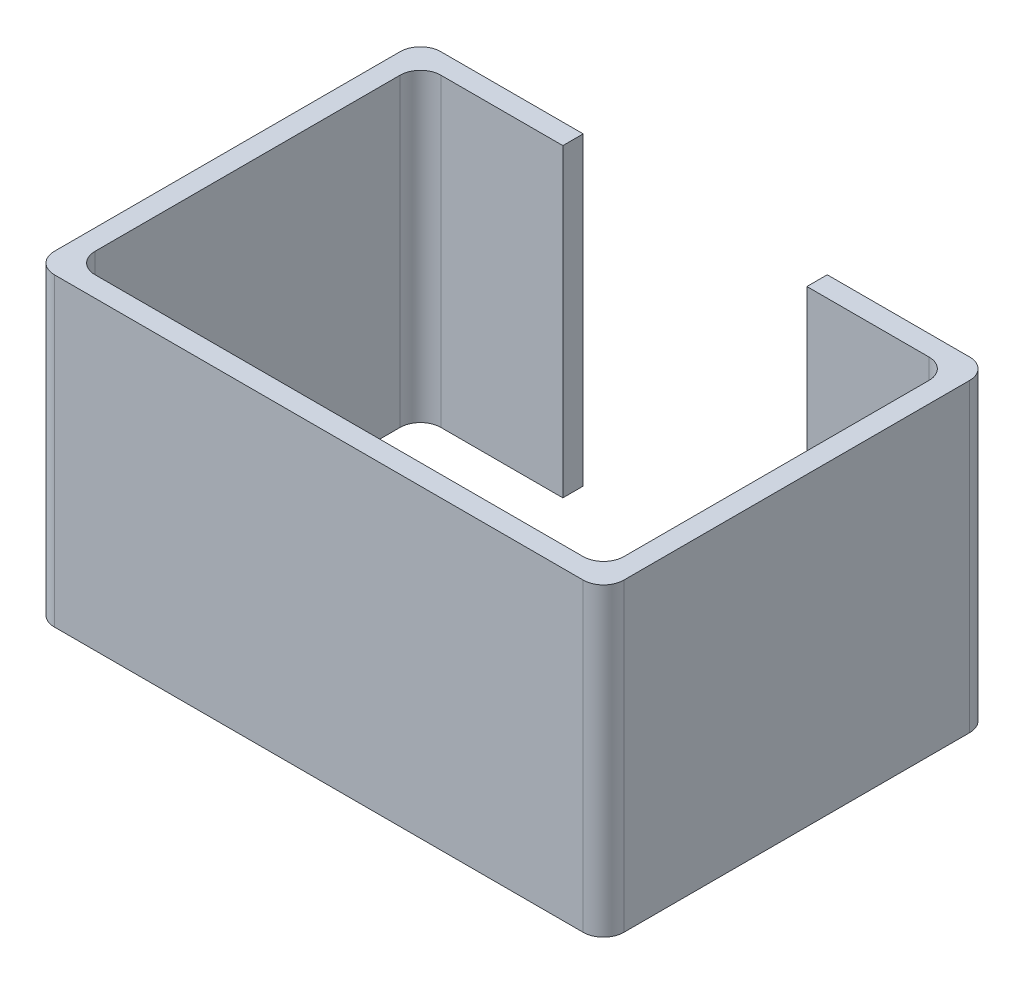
ISO-10303-21;
HEADER;
FILE_DESCRIPTION(('STEP AP214'),'2;1');
FILE_NAME('part.step','',(''),(''),'','','');
FILE_SCHEMA(('AUTOMOTIVE_DESIGN { 1 0 10303 214 1 1 1 1 }'));
ENDSEC;
DATA;
#1=APPLICATION_CONTEXT('core data for automotive mechanical design processes');
#2=APPLICATION_PROTOCOL_DEFINITION('international standard','automotive_design',2000,#1);
#3=PRODUCT_CONTEXT('',#1,'mechanical');
#4=PRODUCT('Part','Part','',(#3));
#5=PRODUCT_RELATED_PRODUCT_CATEGORY('part','',(#4));
#6=PRODUCT_DEFINITION_FORMATION('','',#4);
#7=PRODUCT_DEFINITION_CONTEXT('part definition',#1,'design');
#8=PRODUCT_DEFINITION('design','',#6,#7);
#9=PRODUCT_DEFINITION_SHAPE('','',#8);
#10=(LENGTH_UNIT() NAMED_UNIT(*) SI_UNIT(.MILLI.,.METRE.));
#11=(NAMED_UNIT(*) PLANE_ANGLE_UNIT() SI_UNIT($,.RADIAN.));
#12=(NAMED_UNIT(*) SI_UNIT($,.STERADIAN.) SOLID_ANGLE_UNIT());
#13=UNCERTAINTY_MEASURE_WITH_UNIT(LENGTH_MEASURE(1.E-05),#10,'distance_accuracy_value','');
#14=(GEOMETRIC_REPRESENTATION_CONTEXT(3) GLOBAL_UNCERTAINTY_ASSIGNED_CONTEXT((#13)) GLOBAL_UNIT_ASSIGNED_CONTEXT((#10,
#11,#12)) REPRESENTATION_CONTEXT('',''));
#15=CARTESIAN_POINT('',(0.,0.,0.));
#16=DIRECTION('',(0.,0.,1.));
#17=DIRECTION('',(1.,0.,0.));
#18=AXIS2_PLACEMENT_3D('',#15,#16,#17);
#19=CARTESIAN_POINT('',(0.,15.,0.));
#20=DIRECTION('',(-1.,0.,0.));
#21=DIRECTION('',(0.,0.,1.));
#22=AXIS2_PLACEMENT_3D('',#19,#20,#21);
#23=PLANE('',#22);
#24=DIRECTION('',(0.,0.,-1.));
#25=VECTOR('',#24,1.);
#26=CARTESIAN_POINT('',(0.,0.,0.));
#27=LINE('',#26,#25);
#28=CARTESIAN_POINT('',(0.,0.,1.));
#29=VERTEX_POINT('',#28);
#30=CARTESIAN_POINT('',(0.,0.,0.));
#31=VERTEX_POINT('',#30);
#32=EDGE_CURVE('E174',#29,#31,#27,.T.);
#33=ORIENTED_EDGE('',*,*,#32,.T.);
#34=DIRECTION('',(0.,-1.,0.));
#35=VECTOR('',#34,1.);
#36=CARTESIAN_POINT('',(0.,15.,0.));
#37=LINE('',#36,#35);
#38=CARTESIAN_POINT('',(0.,15.,0.));
#39=VERTEX_POINT('',#38);
#40=EDGE_CURVE('E181',#39,#31,#37,.T.);
#41=ORIENTED_EDGE('',*,*,#40,.F.);
#42=DIRECTION('',(0.,0.,-1.));
#43=VECTOR('',#42,1.);
#44=CARTESIAN_POINT('',(0.,15.,0.));
#45=LINE('',#44,#43);
#46=CARTESIAN_POINT('',(0.,15.,1.));
#47=VERTEX_POINT('',#46);
#48=EDGE_CURVE('E217',#47,#39,#45,.T.);
#49=ORIENTED_EDGE('',*,*,#48,.F.);
#50=DIRECTION('',(0.,-1.,0.));
#51=VECTOR('',#50,1.);
#52=CARTESIAN_POINT('',(0.,15.,1.));
#53=LINE('',#52,#51);
#54=EDGE_CURVE('E193',#47,#29,#53,.T.);
#55=ORIENTED_EDGE('',*,*,#54,.T.);
#56=EDGE_LOOP('',(#33,#41,#49,#55));
#57=FACE_BOUND('',#56,.T.);
#58=ADVANCED_FACE('F34',(#57),#23,.F.);
#59=CARTESIAN_POINT('',(0.,15.,0.));
#60=DIRECTION('',(0.,0.,1.));
#61=DIRECTION('',(1.,0.,0.));
#62=AXIS2_PLACEMENT_3D('',#59,#60,#61);
#63=PLANE('',#62);
#64=DIRECTION('',(-1.,0.,0.));
#65=VECTOR('',#64,1.);
#66=CARTESIAN_POINT('',(0.,0.,0.));
#67=LINE('',#66,#65);
#68=CARTESIAN_POINT('',(-7.,0.,0.));
#69=VERTEX_POINT('',#68);
#70=EDGE_CURVE('E169',#31,#69,#67,.T.);
#71=ORIENTED_EDGE('',*,*,#70,.T.);
#72=DIRECTION('',(0.,-1.,0.));
#73=VECTOR('',#72,1.);
#74=CARTESIAN_POINT('',(-7.,15.,0.));
#75=LINE('',#74,#73);
#76=CARTESIAN_POINT('',(-7.,15.,0.));
#77=VERTEX_POINT('',#76);
#78=EDGE_CURVE('E304',#69,#77,#75,.F.);
#79=ORIENTED_EDGE('',*,*,#78,.T.);
#80=DIRECTION('',(-1.,0.,0.));
#81=VECTOR('',#80,1.);
#82=CARTESIAN_POINT('',(0.,15.,0.));
#83=LINE('',#82,#81);
#84=EDGE_CURVE('E184',#39,#77,#83,.T.);
#85=ORIENTED_EDGE('',*,*,#84,.F.);
#86=ORIENTED_EDGE('',*,*,#40,.T.);
#87=EDGE_LOOP('',(#71,#79,#85,#86));
#88=FACE_BOUND('',#87,.T.);
#89=ADVANCED_FACE('F182',(#88),#63,.F.);
#90=CARTESIAN_POINT('',(-8.,15.,0.));
#91=DIRECTION('',(1.,0.,0.));
#92=DIRECTION('',(0.,0.,-1.));
#93=AXIS2_PLACEMENT_3D('',#90,#91,#92);
#94=PLANE('',#93);
#95=DIRECTION('',(0.,0.,1.));
#96=VECTOR('',#95,1.);
#97=CARTESIAN_POINT('',(-8.,15.,0.));
#98=LINE('',#97,#96);
#99=CARTESIAN_POINT('',(-8.,15.,1.));
#100=VERTEX_POINT('',#99);
#101=CARTESIAN_POINT('',(-8.,15.,18.));
#102=VERTEX_POINT('',#101);
#103=EDGE_CURVE('E220',#100,#102,#98,.T.);
#104=ORIENTED_EDGE('',*,*,#103,.F.);
#105=DIRECTION('',(0.,-1.,0.));
#106=VECTOR('',#105,1.);
#107=CARTESIAN_POINT('',(-8.,15.,1.));
#108=LINE('',#107,#106);
#109=CARTESIAN_POINT('',(-8.,0.,1.));
#110=VERTEX_POINT('',#109);
#111=EDGE_CURVE('E300',#100,#110,#108,.T.);
#112=ORIENTED_EDGE('',*,*,#111,.T.);
#113=DIRECTION('',(0.,0.,1.));
#114=VECTOR('',#113,1.);
#115=CARTESIAN_POINT('',(-8.,0.,0.));
#116=LINE('',#115,#114);
#117=CARTESIAN_POINT('',(-8.,0.,18.));
#118=VERTEX_POINT('',#117);
#119=EDGE_CURVE('E178',#110,#118,#116,.T.);
#120=ORIENTED_EDGE('',*,*,#119,.T.);
#121=DIRECTION('',(0.,-1.,0.));
#122=VECTOR('',#121,1.);
#123=CARTESIAN_POINT('',(-8.,15.,18.));
#124=LINE('',#123,#122);
#125=EDGE_CURVE('E264',#118,#102,#124,.F.);
#126=ORIENTED_EDGE('',*,*,#125,.T.);
#127=EDGE_LOOP('',(#104,#112,#120,#126));
#128=FACE_BOUND('',#127,.T.);
#129=ADVANCED_FACE('F392',(#128),#94,.F.);
#130=CARTESIAN_POINT('',(-8.,15.,19.));
#131=DIRECTION('',(0.,0.,-1.));
#132=DIRECTION('',(-1.,0.,0.));
#133=AXIS2_PLACEMENT_3D('',#130,#131,#132);
#134=PLANE('',#133);
#135=DIRECTION('',(1.,0.,0.));
#136=VECTOR('',#135,1.);
#137=CARTESIAN_POINT('',(-8.,15.,19.));
#138=LINE('',#137,#136);
#139=CARTESIAN_POINT('',(-7.,15.,19.));
#140=VERTEX_POINT('',#139);
#141=CARTESIAN_POINT('',(19.,15.,19.));
#142=VERTEX_POINT('',#141);
#143=EDGE_CURVE('E222',#140,#142,#138,.T.);
#144=ORIENTED_EDGE('',*,*,#143,.F.);
#145=DIRECTION('',(0.,-1.,0.));
#146=VECTOR('',#145,1.);
#147=CARTESIAN_POINT('',(-7.,15.,19.));
#148=LINE('',#147,#146);
#149=CARTESIAN_POINT('',(-7.,0.,19.));
#150=VERTEX_POINT('',#149);
#151=EDGE_CURVE('E258',#140,#150,#148,.T.);
#152=ORIENTED_EDGE('',*,*,#151,.T.);
#153=DIRECTION('',(1.,0.,0.));
#154=VECTOR('',#153,1.);
#155=CARTESIAN_POINT('',(-8.,0.,19.));
#156=LINE('',#155,#154);
#157=CARTESIAN_POINT('',(19.,0.,19.));
#158=VERTEX_POINT('',#157);
#159=EDGE_CURVE('E197',#150,#158,#156,.T.);
#160=ORIENTED_EDGE('',*,*,#159,.T.);
#161=DIRECTION('',(0.,-1.,0.));
#162=VECTOR('',#161,1.);
#163=CARTESIAN_POINT('',(19.,15.,19.));
#164=LINE('',#163,#162);
#165=EDGE_CURVE('E253',#158,#142,#164,.F.);
#166=ORIENTED_EDGE('',*,*,#165,.T.);
#167=EDGE_LOOP('',(#144,#152,#160,#166));
#168=FACE_BOUND('',#167,.T.);
#169=ADVANCED_FACE('F385',(#168),#134,.F.);
#170=CARTESIAN_POINT('',(20.,15.,19.));
#171=DIRECTION('',(-1.,0.,0.));
#172=DIRECTION('',(0.,0.,1.));
#173=AXIS2_PLACEMENT_3D('',#170,#171,#172);
#174=PLANE('',#173);
#175=DIRECTION('',(0.,0.,-1.));
#176=VECTOR('',#175,1.);
#177=CARTESIAN_POINT('',(20.,0.,19.));
#178=LINE('',#177,#176);
#179=CARTESIAN_POINT('',(20.,0.,18.));
#180=VERTEX_POINT('',#179);
#181=CARTESIAN_POINT('',(20.,0.,1.));
#182=VERTEX_POINT('',#181);
#183=EDGE_CURVE('E199',#180,#182,#178,.T.);
#184=ORIENTED_EDGE('',*,*,#183,.T.);
#185=DIRECTION('',(0.,-1.,0.));
#186=VECTOR('',#185,1.);
#187=CARTESIAN_POINT('',(20.,15.,1.));
#188=LINE('',#187,#186);
#189=CARTESIAN_POINT('',(20.,15.,1.));
#190=VERTEX_POINT('',#189);
#191=EDGE_CURVE('E274',#182,#190,#188,.F.);
#192=ORIENTED_EDGE('',*,*,#191,.T.);
#193=DIRECTION('',(0.,0.,-1.));
#194=VECTOR('',#193,1.);
#195=CARTESIAN_POINT('',(20.,15.,19.));
#196=LINE('',#195,#194);
#197=CARTESIAN_POINT('',(20.,15.,18.));
#198=VERTEX_POINT('',#197);
#199=EDGE_CURVE('E224',#198,#190,#196,.T.);
#200=ORIENTED_EDGE('',*,*,#199,.F.);
#201=DIRECTION('',(0.,-1.,0.));
#202=VECTOR('',#201,1.);
#203=CARTESIAN_POINT('',(20.,15.,18.));
#204=LINE('',#203,#202);
#205=EDGE_CURVE('E188',#198,#180,#204,.T.);
#206=ORIENTED_EDGE('',*,*,#205,.T.);
#207=EDGE_LOOP('',(#184,#192,#200,#206));
#208=FACE_BOUND('',#207,.T.);
#209=ADVANCED_FACE('F375',(#208),#174,.F.);
#210=CARTESIAN_POINT('',(20.,15.,0.));
#211=DIRECTION('',(0.,0.,1.));
#212=DIRECTION('',(1.,0.,0.));
#213=AXIS2_PLACEMENT_3D('',#210,#211,#212);
#214=PLANE('',#213);
#215=DIRECTION('',(-1.,0.,0.));
#216=VECTOR('',#215,1.);
#217=CARTESIAN_POINT('',(20.,15.,0.));
#218=LINE('',#217,#216);
#219=CARTESIAN_POINT('',(19.,15.,0.));
#220=VERTEX_POINT('',#219);
#221=CARTESIAN_POINT('',(12.,15.,0.));
#222=VERTEX_POINT('',#221);
#223=EDGE_CURVE('E227',#220,#222,#218,.T.);
#224=ORIENTED_EDGE('',*,*,#223,.F.);
#225=DIRECTION('',(0.,-1.,0.));
#226=VECTOR('',#225,1.);
#227=CARTESIAN_POINT('',(19.,15.,0.));
#228=LINE('',#227,#226);
#229=CARTESIAN_POINT('',(19.,0.,0.));
#230=VERTEX_POINT('',#229);
#231=EDGE_CURVE('E269',#220,#230,#228,.T.);
#232=ORIENTED_EDGE('',*,*,#231,.T.);
#233=DIRECTION('',(-1.,0.,0.));
#234=VECTOR('',#233,1.);
#235=CARTESIAN_POINT('',(20.,0.,0.));
#236=LINE('',#235,#234);
#237=CARTESIAN_POINT('',(12.,0.,0.));
#238=VERTEX_POINT('',#237);
#239=EDGE_CURVE('E202',#230,#238,#236,.T.);
#240=ORIENTED_EDGE('',*,*,#239,.T.);
#241=DIRECTION('',(0.,-1.,0.));
#242=VECTOR('',#241,1.);
#243=CARTESIAN_POINT('',(12.,15.,0.));
#244=LINE('',#243,#242);
#245=EDGE_CURVE('E189',#222,#238,#244,.T.);
#246=ORIENTED_EDGE('',*,*,#245,.F.);
#247=EDGE_LOOP('',(#224,#232,#240,#246));
#248=FACE_BOUND('',#247,.T.);
#249=ADVANCED_FACE('F367',(#248),#214,.F.);
#250=CARTESIAN_POINT('',(12.,15.,0.));
#251=DIRECTION('',(1.,0.,0.));
#252=DIRECTION('',(0.,0.,-1.));
#253=AXIS2_PLACEMENT_3D('',#250,#251,#252);
#254=PLANE('',#253);
#255=DIRECTION('',(0.,0.,1.));
#256=VECTOR('',#255,1.);
#257=CARTESIAN_POINT('',(12.,0.,0.));
#258=LINE('',#257,#256);
#259=CARTESIAN_POINT('',(12.,0.,1.));
#260=VERTEX_POINT('',#259);
#261=EDGE_CURVE('E204',#238,#260,#258,.T.);
#262=ORIENTED_EDGE('',*,*,#261,.T.);
#263=DIRECTION('',(0.,-1.,0.));
#264=VECTOR('',#263,1.);
#265=CARTESIAN_POINT('',(12.,15.,1.));
#266=LINE('',#265,#264);
#267=CARTESIAN_POINT('',(12.,15.,1.));
#268=VERTEX_POINT('',#267);
#269=EDGE_CURVE('E243',#268,#260,#266,.T.);
#270=ORIENTED_EDGE('',*,*,#269,.F.);
#271=DIRECTION('',(0.,0.,1.));
#272=VECTOR('',#271,1.);
#273=CARTESIAN_POINT('',(12.,15.,0.));
#274=LINE('',#273,#272);
#275=EDGE_CURVE('E229',#222,#268,#274,.T.);
#276=ORIENTED_EDGE('',*,*,#275,.F.);
#277=ORIENTED_EDGE('',*,*,#245,.T.);
#278=EDGE_LOOP('',(#262,#270,#276,#277));
#279=FACE_BOUND('',#278,.T.);
#280=ADVANCED_FACE('F363',(#279),#254,.F.);
#281=CARTESIAN_POINT('',(19.,15.,1.));
#282=DIRECTION('',(0.,0.,-1.));
#283=DIRECTION('',(-1.,0.,0.));
#284=AXIS2_PLACEMENT_3D('',#281,#282,#283);
#285=PLANE('',#284);
#286=DIRECTION('',(1.,0.,0.));
#287=VECTOR('',#286,1.);
#288=CARTESIAN_POINT('',(19.,0.,1.));
#289=LINE('',#288,#287);
#290=CARTESIAN_POINT('',(18.,0.,1.));
#291=VERTEX_POINT('',#290);
#292=EDGE_CURVE('E206',#260,#291,#289,.T.);
#293=ORIENTED_EDGE('',*,*,#292,.T.);
#294=DIRECTION('',(0.,-1.,0.));
#295=VECTOR('',#294,1.);
#296=CARTESIAN_POINT('',(18.,15.,1.));
#297=LINE('',#296,#295);
#298=CARTESIAN_POINT('',(18.,15.,1.));
#299=VERTEX_POINT('',#298);
#300=EDGE_CURVE('E311',#291,#299,#297,.F.);
#301=ORIENTED_EDGE('',*,*,#300,.T.);
#302=DIRECTION('',(1.,0.,0.));
#303=VECTOR('',#302,1.);
#304=CARTESIAN_POINT('',(19.,15.,1.));
#305=LINE('',#304,#303);
#306=EDGE_CURVE('E231',#268,#299,#305,.T.);
#307=ORIENTED_EDGE('',*,*,#306,.F.);
#308=ORIENTED_EDGE('',*,*,#269,.T.);
#309=EDGE_LOOP('',(#293,#301,#307,#308));
#310=FACE_BOUND('',#309,.T.);
#311=ADVANCED_FACE('F354',(#310),#285,.F.);
#312=CARTESIAN_POINT('',(19.,15.,18.));
#313=DIRECTION('',(1.,0.,0.));
#314=DIRECTION('',(0.,0.,-1.));
#315=AXIS2_PLACEMENT_3D('',#312,#313,#314);
#316=PLANE('',#315);
#317=DIRECTION('',(0.,0.,1.));
#318=VECTOR('',#317,1.);
#319=CARTESIAN_POINT('',(19.,15.,18.));
#320=LINE('',#319,#318);
#321=CARTESIAN_POINT('',(19.,15.,2.00000000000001));
#322=VERTEX_POINT('',#321);
#323=CARTESIAN_POINT('',(19.,15.,17.));
#324=VERTEX_POINT('',#323);
#325=EDGE_CURVE('E234',#322,#324,#320,.T.);
#326=ORIENTED_EDGE('',*,*,#325,.F.);
#327=DIRECTION('',(0.,-1.,0.));
#328=VECTOR('',#327,1.);
#329=CARTESIAN_POINT('',(19.,0.,2.00000000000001));
#330=LINE('',#329,#328);
#331=CARTESIAN_POINT('',(19.,0.,2.00000000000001));
#332=VERTEX_POINT('',#331);
#333=EDGE_CURVE('E308',#322,#332,#330,.T.);
#334=ORIENTED_EDGE('',*,*,#333,.T.);
#335=DIRECTION('',(0.,0.,1.));
#336=VECTOR('',#335,1.);
#337=CARTESIAN_POINT('',(19.,0.,18.));
#338=LINE('',#337,#336);
#339=CARTESIAN_POINT('',(19.,0.,17.));
#340=VERTEX_POINT('',#339);
#341=EDGE_CURVE('E209',#332,#340,#338,.T.);
#342=ORIENTED_EDGE('',*,*,#341,.T.);
#343=DIRECTION('',(0.,-1.,0.));
#344=VECTOR('',#343,1.);
#345=CARTESIAN_POINT('',(19.,15.,17.));
#346=LINE('',#345,#344);
#347=EDGE_CURVE('E292',#340,#324,#346,.F.);
#348=ORIENTED_EDGE('',*,*,#347,.T.);
#349=EDGE_LOOP('',(#326,#334,#342,#348));
#350=FACE_BOUND('',#349,.T.);
#351=ADVANCED_FACE('F347',(#350),#316,.F.);
#352=CARTESIAN_POINT('',(-7.,15.,18.));
#353=DIRECTION('',(0.,0.,1.));
#354=DIRECTION('',(1.,0.,0.));
#355=AXIS2_PLACEMENT_3D('',#352,#353,#354);
#356=PLANE('',#355);
#357=DIRECTION('',(-1.,0.,0.));
#358=VECTOR('',#357,1.);
#359=CARTESIAN_POINT('',(-7.,15.,18.));
#360=LINE('',#359,#358);
#361=CARTESIAN_POINT('',(18.,15.,18.));
#362=VERTEX_POINT('',#361);
#363=CARTESIAN_POINT('',(-6.,15.,18.));
#364=VERTEX_POINT('',#363);
#365=EDGE_CURVE('E236',#362,#364,#360,.T.);
#366=ORIENTED_EDGE('',*,*,#365,.F.);
#367=DIRECTION('',(0.,-1.,0.));
#368=VECTOR('',#367,1.);
#369=CARTESIAN_POINT('',(18.,0.,18.));
#370=LINE('',#369,#368);
#371=CARTESIAN_POINT('',(18.,0.,18.));
#372=VERTEX_POINT('',#371);
#373=EDGE_CURVE('E289',#362,#372,#370,.T.);
#374=ORIENTED_EDGE('',*,*,#373,.T.);
#375=DIRECTION('',(-1.,0.,0.));
#376=VECTOR('',#375,1.);
#377=CARTESIAN_POINT('',(-7.,0.,18.));
#378=LINE('',#377,#376);
#379=CARTESIAN_POINT('',(-6.,0.,18.));
#380=VERTEX_POINT('',#379);
#381=EDGE_CURVE('E211',#372,#380,#378,.T.);
#382=ORIENTED_EDGE('',*,*,#381,.T.);
#383=DIRECTION('',(0.,-1.,0.));
#384=VECTOR('',#383,1.);
#385=CARTESIAN_POINT('',(-6.,15.,18.));
#386=LINE('',#385,#384);
#387=EDGE_CURVE('E281',#380,#364,#386,.F.);
#388=ORIENTED_EDGE('',*,*,#387,.T.);
#389=EDGE_LOOP('',(#366,#374,#382,#388));
#390=FACE_BOUND('',#389,.T.);
#391=ADVANCED_FACE('F340',(#390),#356,.F.);
#392=CARTESIAN_POINT('',(-7.,15.,1.));
#393=DIRECTION('',(-1.,0.,0.));
#394=DIRECTION('',(0.,0.,1.));
#395=AXIS2_PLACEMENT_3D('',#392,#393,#394);
#396=PLANE('',#395);
#397=DIRECTION('',(0.,0.,-1.));
#398=VECTOR('',#397,1.);
#399=CARTESIAN_POINT('',(-7.,0.,1.));
#400=LINE('',#399,#398);
#401=CARTESIAN_POINT('',(-7.,0.,17.));
#402=VERTEX_POINT('',#401);
#403=CARTESIAN_POINT('',(-7.,0.,2.));
#404=VERTEX_POINT('',#403);
#405=EDGE_CURVE('E213',#402,#404,#400,.T.);
#406=ORIENTED_EDGE('',*,*,#405,.T.);
#407=DIRECTION('',(0.,-1.,0.));
#408=VECTOR('',#407,1.);
#409=CARTESIAN_POINT('',(-7.,15.,2.));
#410=LINE('',#409,#408);
#411=CARTESIAN_POINT('',(-7.,15.,2.));
#412=VERTEX_POINT('',#411);
#413=EDGE_CURVE('E54',#404,#412,#410,.F.);
#414=ORIENTED_EDGE('',*,*,#413,.T.);
#415=DIRECTION('',(0.,0.,-1.));
#416=VECTOR('',#415,1.);
#417=CARTESIAN_POINT('',(-7.,15.,1.));
#418=LINE('',#417,#416);
#419=CARTESIAN_POINT('',(-7.,15.,17.));
#420=VERTEX_POINT('',#419);
#421=EDGE_CURVE('E238',#420,#412,#418,.T.);
#422=ORIENTED_EDGE('',*,*,#421,.F.);
#423=DIRECTION('',(0.,-1.,0.));
#424=VECTOR('',#423,1.);
#425=CARTESIAN_POINT('',(-7.,0.,17.));
#426=LINE('',#425,#424);
#427=EDGE_CURVE('E278',#420,#402,#426,.T.);
#428=ORIENTED_EDGE('',*,*,#427,.T.);
#429=EDGE_LOOP('',(#406,#414,#422,#428));
#430=FACE_BOUND('',#429,.T.);
#431=ADVANCED_FACE('F331',(#430),#396,.F.);
#432=CARTESIAN_POINT('',(0.,15.,1.));
#433=DIRECTION('',(0.,0.,-1.));
#434=DIRECTION('',(-1.,0.,0.));
#435=AXIS2_PLACEMENT_3D('',#432,#433,#434);
#436=PLANE('',#435);
#437=DIRECTION('',(1.,0.,0.));
#438=VECTOR('',#437,1.);
#439=CARTESIAN_POINT('',(0.,15.,1.));
#440=LINE('',#439,#438);
#441=CARTESIAN_POINT('',(-6.,15.,1.));
#442=VERTEX_POINT('',#441);
#443=EDGE_CURVE('E240',#442,#47,#440,.T.);
#444=ORIENTED_EDGE('',*,*,#443,.F.);
#445=DIRECTION('',(0.,-1.,0.));
#446=VECTOR('',#445,1.);
#447=CARTESIAN_POINT('',(-6.,0.,1.));
#448=LINE('',#447,#446);
#449=CARTESIAN_POINT('',(-6.,0.,1.));
#450=VERTEX_POINT('',#449);
#451=EDGE_CURVE('E317',#442,#450,#448,.T.);
#452=ORIENTED_EDGE('',*,*,#451,.T.);
#453=DIRECTION('',(1.,0.,0.));
#454=VECTOR('',#453,1.);
#455=CARTESIAN_POINT('',(0.,0.,1.));
#456=LINE('',#455,#454);
#457=EDGE_CURVE('E215',#450,#29,#456,.T.);
#458=ORIENTED_EDGE('',*,*,#457,.T.);
#459=ORIENTED_EDGE('',*,*,#54,.F.);
#460=EDGE_LOOP('',(#444,#452,#458,#459));
#461=FACE_BOUND('',#460,.T.);
#462=ADVANCED_FACE('F323',(#461),#436,.F.);
#463=CARTESIAN_POINT('',(0.,15.,1.));
#464=DIRECTION('',(0.,-1.,0.));
#465=DIRECTION('',(0.,0.,-1.));
#466=AXIS2_PLACEMENT_3D('',#463,#464,#465);
#467=PLANE('',#466);
#468=ORIENTED_EDGE('',*,*,#84,.T.);
#469=CARTESIAN_POINT('',(-7.,15.,1.));
#470=DIRECTION('',(0.,-1.,0.));
#471=DIRECTION('',(0.,0.,-1.));
#472=AXIS2_PLACEMENT_3D('',#469,#470,#471);
#473=CIRCLE('',#472,1.);
#474=EDGE_CURVE('E306',#77,#100,#473,.F.);
#475=ORIENTED_EDGE('',*,*,#474,.T.);
#476=ORIENTED_EDGE('',*,*,#103,.T.);
#477=CARTESIAN_POINT('',(-7.,15.,18.));
#478=DIRECTION('',(0.,-1.,0.));
#479=DIRECTION('',(0.,0.,-1.));
#480=AXIS2_PLACEMENT_3D('',#477,#478,#479);
#481=CIRCLE('',#480,1.);
#482=EDGE_CURVE('E267',#102,#140,#481,.F.);
#483=ORIENTED_EDGE('',*,*,#482,.T.);
#484=ORIENTED_EDGE('',*,*,#143,.T.);
#485=CARTESIAN_POINT('',(19.,15.,18.));
#486=DIRECTION('',(0.,-1.,0.));
#487=DIRECTION('',(0.,0.,-1.));
#488=AXIS2_PLACEMENT_3D('',#485,#486,#487);
#489=CIRCLE('',#488,1.);
#490=EDGE_CURVE('E256',#142,#198,#489,.F.);
#491=ORIENTED_EDGE('',*,*,#490,.T.);
#492=ORIENTED_EDGE('',*,*,#199,.T.);
#493=CARTESIAN_POINT('',(19.,15.,1.));
#494=DIRECTION('',(0.,-1.,0.));
#495=DIRECTION('',(0.,0.,-1.));
#496=AXIS2_PLACEMENT_3D('',#493,#494,#495);
#497=CIRCLE('',#496,1.);
#498=EDGE_CURVE('E276',#190,#220,#497,.F.);
#499=ORIENTED_EDGE('',*,*,#498,.T.);
#500=ORIENTED_EDGE('',*,*,#223,.T.);
#501=ORIENTED_EDGE('',*,*,#275,.T.);
#502=ORIENTED_EDGE('',*,*,#306,.T.);
#503=CARTESIAN_POINT('',(18.,15.,2.00000000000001));
#504=DIRECTION('',(0.,-1.,0.));
#505=DIRECTION('',(0.,0.,-1.));
#506=AXIS2_PLACEMENT_3D('',#503,#504,#505);
#507=CIRCLE('',#506,1.);
#508=EDGE_CURVE('E315',#299,#322,#507,.T.);
#509=ORIENTED_EDGE('',*,*,#508,.T.);
#510=ORIENTED_EDGE('',*,*,#325,.T.);
#511=CARTESIAN_POINT('',(18.,15.,17.));
#512=DIRECTION('',(0.,-1.,0.));
#513=DIRECTION('',(0.,0.,-1.));
#514=AXIS2_PLACEMENT_3D('',#511,#512,#513);
#515=CIRCLE('',#514,1.);
#516=EDGE_CURVE('E298',#324,#362,#515,.T.);
#517=ORIENTED_EDGE('',*,*,#516,.T.);
#518=ORIENTED_EDGE('',*,*,#365,.T.);
#519=CARTESIAN_POINT('',(-6.,15.,17.));
#520=DIRECTION('',(0.,-1.,0.));
#521=DIRECTION('',(0.,0.,-1.));
#522=AXIS2_PLACEMENT_3D('',#519,#520,#521);
#523=CIRCLE('',#522,1.);
#524=EDGE_CURVE('E287',#364,#420,#523,.T.);
#525=ORIENTED_EDGE('',*,*,#524,.T.);
#526=ORIENTED_EDGE('',*,*,#421,.T.);
#527=CARTESIAN_POINT('',(-6.,15.,2.));
#528=DIRECTION('',(0.,-1.,0.));
#529=DIRECTION('',(0.,0.,-1.));
#530=AXIS2_PLACEMENT_3D('',#527,#528,#529);
#531=CIRCLE('',#530,1.);
#532=EDGE_CURVE('E11',#412,#442,#531,.T.);
#533=ORIENTED_EDGE('',*,*,#532,.T.);
#534=ORIENTED_EDGE('',*,*,#443,.T.);
#535=ORIENTED_EDGE('',*,*,#48,.T.);
#536=EDGE_LOOP('',(#468,#475,#476,#483,#484,#491,#492,#499,#500,#501,#502,#509,#510,#517,#518,
#525,#526,#533,#534,#535));
#537=FACE_BOUND('',#536,.T.);
#538=ADVANCED_FACE('F328',(#537),#467,.F.);
#539=CARTESIAN_POINT('',(0.,0.,1.));
#540=DIRECTION('',(0.,-1.,0.));
#541=DIRECTION('',(0.,0.,-1.));
#542=AXIS2_PLACEMENT_3D('',#539,#540,#541);
#543=PLANE('',#542);
#544=ORIENTED_EDGE('',*,*,#119,.F.);
#545=CARTESIAN_POINT('',(-7.,0.,1.));
#546=DIRECTION('',(0.,-1.,0.));
#547=DIRECTION('',(0.,0.,-1.));
#548=AXIS2_PLACEMENT_3D('',#545,#546,#547);
#549=CIRCLE('',#548,1.);
#550=EDGE_CURVE('E175',#110,#69,#549,.T.);
#551=ORIENTED_EDGE('',*,*,#550,.T.);
#552=ORIENTED_EDGE('',*,*,#70,.F.);
#553=ORIENTED_EDGE('',*,*,#32,.F.);
#554=ORIENTED_EDGE('',*,*,#457,.F.);
#555=CARTESIAN_POINT('',(-6.,0.,2.));
#556=DIRECTION('',(0.,-1.,0.));
#557=DIRECTION('',(0.,0.,-1.));
#558=AXIS2_PLACEMENT_3D('',#555,#556,#557);
#559=CIRCLE('',#558,1.);
#560=EDGE_CURVE('E41',#450,#404,#559,.F.);
#561=ORIENTED_EDGE('',*,*,#560,.T.);
#562=ORIENTED_EDGE('',*,*,#405,.F.);
#563=CARTESIAN_POINT('',(-6.,0.,17.));
#564=DIRECTION('',(0.,-1.,0.));
#565=DIRECTION('',(0.,0.,-1.));
#566=AXIS2_PLACEMENT_3D('',#563,#564,#565);
#567=CIRCLE('',#566,1.);
#568=EDGE_CURVE('E284',#402,#380,#567,.F.);
#569=ORIENTED_EDGE('',*,*,#568,.T.);
#570=ORIENTED_EDGE('',*,*,#381,.F.);
#571=CARTESIAN_POINT('',(18.,0.,17.));
#572=DIRECTION('',(0.,-1.,0.));
#573=DIRECTION('',(0.,0.,-1.));
#574=AXIS2_PLACEMENT_3D('',#571,#572,#573);
#575=CIRCLE('',#574,1.);
#576=EDGE_CURVE('E295',#372,#340,#575,.F.);
#577=ORIENTED_EDGE('',*,*,#576,.T.);
#578=ORIENTED_EDGE('',*,*,#341,.F.);
#579=CARTESIAN_POINT('',(18.,0.,2.00000000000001));
#580=DIRECTION('',(0.,-1.,0.));
#581=DIRECTION('',(0.,0.,-1.));
#582=AXIS2_PLACEMENT_3D('',#579,#580,#581);
#583=CIRCLE('',#582,1.);
#584=EDGE_CURVE('E313',#332,#291,#583,.F.);
#585=ORIENTED_EDGE('',*,*,#584,.T.);
#586=ORIENTED_EDGE('',*,*,#292,.F.);
#587=ORIENTED_EDGE('',*,*,#261,.F.);
#588=ORIENTED_EDGE('',*,*,#239,.F.);
#589=CARTESIAN_POINT('',(19.,0.,1.));
#590=DIRECTION('',(0.,-1.,0.));
#591=DIRECTION('',(0.,0.,-1.));
#592=AXIS2_PLACEMENT_3D('',#589,#590,#591);
#593=CIRCLE('',#592,1.);
#594=EDGE_CURVE('E272',#230,#182,#593,.T.);
#595=ORIENTED_EDGE('',*,*,#594,.T.);
#596=ORIENTED_EDGE('',*,*,#183,.F.);
#597=CARTESIAN_POINT('',(19.,0.,18.));
#598=DIRECTION('',(0.,-1.,0.));
#599=DIRECTION('',(0.,0.,-1.));
#600=AXIS2_PLACEMENT_3D('',#597,#598,#599);
#601=CIRCLE('',#600,1.);
#602=EDGE_CURVE('E250',#180,#158,#601,.T.);
#603=ORIENTED_EDGE('',*,*,#602,.T.);
#604=ORIENTED_EDGE('',*,*,#159,.F.);
#605=CARTESIAN_POINT('',(-7.,0.,18.));
#606=DIRECTION('',(0.,-1.,0.));
#607=DIRECTION('',(0.,0.,-1.));
#608=AXIS2_PLACEMENT_3D('',#605,#606,#607);
#609=CIRCLE('',#608,1.);
#610=EDGE_CURVE('E261',#150,#118,#609,.T.);
#611=ORIENTED_EDGE('',*,*,#610,.T.);
#612=EDGE_LOOP('',(#544,#551,#552,#553,#554,#561,#562,#569,#570,#577,#578,#585,#586,#587,#588,
#595,#596,#603,#604,#611));
#613=FACE_BOUND('',#612,.T.);
#614=ADVANCED_FACE('F172',(#613),#543,.T.);
#615=CARTESIAN_POINT('',(19.,15.,18.));
#616=DIRECTION('',(0.,-1.,0.));
#617=DIRECTION('',(0.,0.,-1.));
#618=AXIS2_PLACEMENT_3D('',#615,#616,#617);
#619=CYLINDRICAL_SURFACE('',#618,1.);
#620=ORIENTED_EDGE('',*,*,#490,.F.);
#621=ORIENTED_EDGE('',*,*,#165,.F.);
#622=ORIENTED_EDGE('',*,*,#602,.F.);
#623=ORIENTED_EDGE('',*,*,#205,.F.);
#624=EDGE_LOOP('',(#620,#621,#622,#623));
#625=FACE_BOUND('',#624,.T.);
#626=ADVANCED_FACE('F381',(#625),#619,.T.);
#627=CARTESIAN_POINT('',(-7.,15.,18.));
#628=DIRECTION('',(0.,-1.,0.));
#629=DIRECTION('',(0.,0.,-1.));
#630=AXIS2_PLACEMENT_3D('',#627,#628,#629);
#631=CYLINDRICAL_SURFACE('',#630,1.);
#632=ORIENTED_EDGE('',*,*,#482,.F.);
#633=ORIENTED_EDGE('',*,*,#125,.F.);
#634=ORIENTED_EDGE('',*,*,#610,.F.);
#635=ORIENTED_EDGE('',*,*,#151,.F.);
#636=EDGE_LOOP('',(#632,#633,#634,#635));
#637=FACE_BOUND('',#636,.T.);
#638=ADVANCED_FACE('F389',(#637),#631,.T.);
#639=CARTESIAN_POINT('',(19.,15.,1.));
#640=DIRECTION('',(0.,-1.,0.));
#641=DIRECTION('',(0.,0.,-1.));
#642=AXIS2_PLACEMENT_3D('',#639,#640,#641);
#643=CYLINDRICAL_SURFACE('',#642,1.);
#644=ORIENTED_EDGE('',*,*,#498,.F.);
#645=ORIENTED_EDGE('',*,*,#191,.F.);
#646=ORIENTED_EDGE('',*,*,#594,.F.);
#647=ORIENTED_EDGE('',*,*,#231,.F.);
#648=EDGE_LOOP('',(#644,#645,#646,#647));
#649=FACE_BOUND('',#648,.T.);
#650=ADVANCED_FACE('F371',(#649),#643,.T.);
#651=CARTESIAN_POINT('',(-6.,15.,17.));
#652=DIRECTION('',(0.,1.,0.));
#653=DIRECTION('',(0.,0.,1.));
#654=AXIS2_PLACEMENT_3D('',#651,#652,#653);
#655=CYLINDRICAL_SURFACE('',#654,1.);
#656=ORIENTED_EDGE('',*,*,#524,.F.);
#657=ORIENTED_EDGE('',*,*,#387,.F.);
#658=ORIENTED_EDGE('',*,*,#568,.F.);
#659=ORIENTED_EDGE('',*,*,#427,.F.);
#660=EDGE_LOOP('',(#656,#657,#658,#659));
#661=FACE_BOUND('',#660,.T.);
#662=ADVANCED_FACE('F333',(#661),#655,.F.);
#663=CARTESIAN_POINT('',(18.,15.,17.));
#664=DIRECTION('',(0.,1.,0.));
#665=DIRECTION('',(0.,0.,1.));
#666=AXIS2_PLACEMENT_3D('',#663,#664,#665);
#667=CYLINDRICAL_SURFACE('',#666,1.);
#668=ORIENTED_EDGE('',*,*,#516,.F.);
#669=ORIENTED_EDGE('',*,*,#347,.F.);
#670=ORIENTED_EDGE('',*,*,#576,.F.);
#671=ORIENTED_EDGE('',*,*,#373,.F.);
#672=EDGE_LOOP('',(#668,#669,#670,#671));
#673=FACE_BOUND('',#672,.T.);
#674=ADVANCED_FACE('F344',(#673),#667,.F.);
#675=CARTESIAN_POINT('',(-7.,15.,1.));
#676=DIRECTION('',(0.,-1.,0.));
#677=DIRECTION('',(0.,0.,-1.));
#678=AXIS2_PLACEMENT_3D('',#675,#676,#677);
#679=CYLINDRICAL_SURFACE('',#678,1.);
#680=ORIENTED_EDGE('',*,*,#474,.F.);
#681=ORIENTED_EDGE('',*,*,#78,.F.);
#682=ORIENTED_EDGE('',*,*,#550,.F.);
#683=ORIENTED_EDGE('',*,*,#111,.F.);
#684=EDGE_LOOP('',(#680,#681,#682,#683));
#685=FACE_BOUND('',#684,.T.);
#686=ADVANCED_FACE('F396',(#685),#679,.T.);
#687=CARTESIAN_POINT('',(18.,15.,2.00000000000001));
#688=DIRECTION('',(0.,1.,0.));
#689=DIRECTION('',(0.,0.,1.));
#690=AXIS2_PLACEMENT_3D('',#687,#688,#689);
#691=CYLINDRICAL_SURFACE('',#690,1.);
#692=ORIENTED_EDGE('',*,*,#508,.F.);
#693=ORIENTED_EDGE('',*,*,#300,.F.);
#694=ORIENTED_EDGE('',*,*,#584,.F.);
#695=ORIENTED_EDGE('',*,*,#333,.F.);
#696=EDGE_LOOP('',(#692,#693,#694,#695));
#697=FACE_BOUND('',#696,.T.);
#698=ADVANCED_FACE('F358',(#697),#691,.F.);
#699=CARTESIAN_POINT('',(-6.,15.,2.));
#700=DIRECTION('',(0.,1.,0.));
#701=DIRECTION('',(0.,0.,1.));
#702=AXIS2_PLACEMENT_3D('',#699,#700,#701);
#703=CYLINDRICAL_SURFACE('',#702,1.);
#704=ORIENTED_EDGE('',*,*,#532,.F.);
#705=ORIENTED_EDGE('',*,*,#413,.F.);
#706=ORIENTED_EDGE('',*,*,#560,.F.);
#707=ORIENTED_EDGE('',*,*,#451,.F.);
#708=EDGE_LOOP('',(#704,#705,#706,#707));
#709=FACE_BOUND('',#708,.T.);
#710=ADVANCED_FACE('F326',(#709),#703,.F.);
#711=CLOSED_SHELL('',(#58,#89,#129,#169,#209,#249,#280,#311,#351,#391,#431,#462,#538,#614,#626,
#638,#650,#662,#674,#686,#698,#710));
#712=MANIFOLD_SOLID_BREP('B2',#711);
#713=ADVANCED_BREP_SHAPE_REPRESENTATION('',(#18,#712),#14);
#714=SHAPE_DEFINITION_REPRESENTATION(#9,#713);
ENDSEC;
END-ISO-10303-21;
